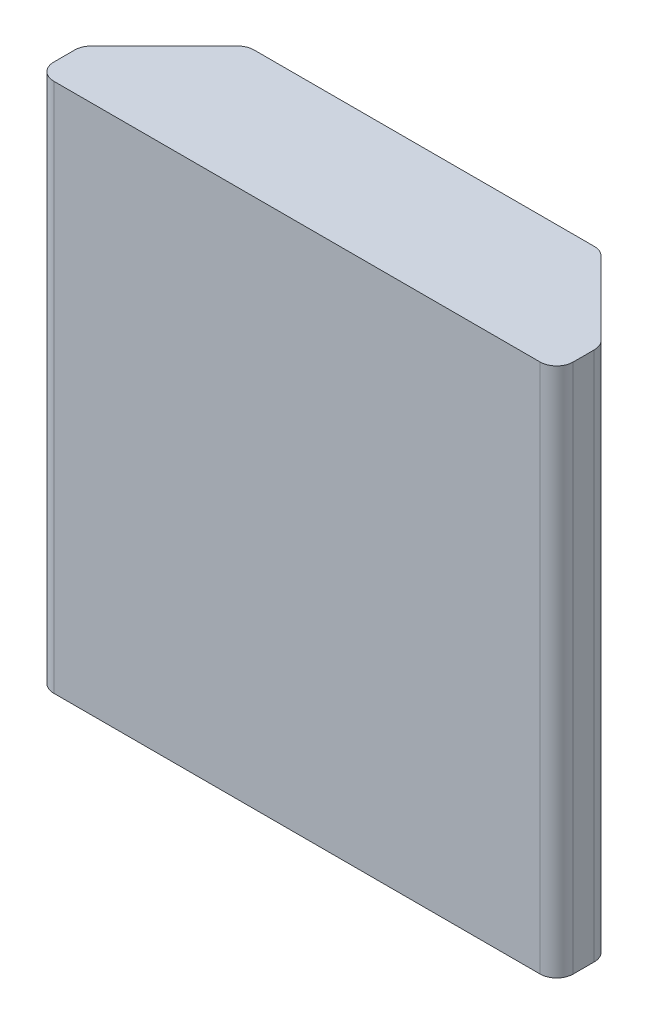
from build123d import *

# Parameters (mm, degrees)
BOSS_EXTRUDE1_DEPTH = 12.7


with BuildPart() as part:
    # Sketch1 → Boss-Extrude1 (new body)
    with BuildSketch(Plane(origin=(0, 0, 0), x_dir=(1, 0, 0), z_dir=(0, 1, 0))):
        with BuildLine():
            Line((-6.223, 0.396875), (-6.223, 0.899233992))
            ThreePointArc((-6.223, 0.899233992), (-6.192789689, 1.05111148), (-6.106758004, 1.179866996))
            Line((-6.106758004, 1.179866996), (-4.354866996, 2.931758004))
            ThreePointArc((-4.354866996, 2.931758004), (-4.22611148, 3.017789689), (-4.074233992, 3.048))
            Line((-4.074233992, 3.048), (4.074233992, 3.048))
            ThreePointArc((4.074233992, 3.048), (4.22611148, 3.017789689), (4.354866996, 2.931758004))
            Line((4.354866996, 2.931758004), (6.106758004, 1.179866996))
            ThreePointArc((6.106758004, 1.179866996), (6.192789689, 1.05111148), (6.223, 0.899233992))
            Line((6.223, 0.899233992), (6.223, 0.396875))
            ThreePointArc((6.223, 0.396875), (6.106758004, 0.116241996), (5.826125, 0))
            Line((5.826125, 0), (-5.826125, 0))
            ThreePointArc((-5.826125, 0), (-6.106758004, 0.116241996), (-6.223, 0.396875))
        make_face()
    extrude(amount=BOSS_EXTRUDE1_DEPTH)


solid = part.part
